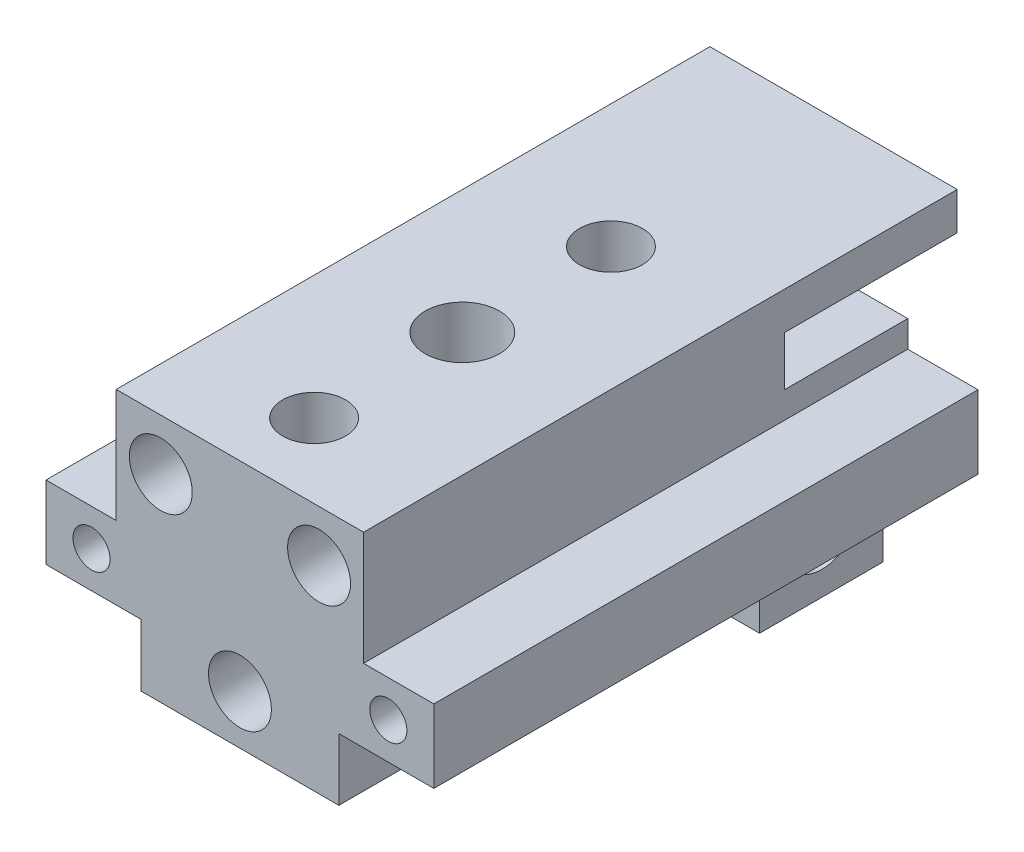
from build123d import *

# Parameters (mm, degrees)
SKETCH1_W                         = 24.892
SKETCH1_H                         = 38.1
EXTRUDE1_DEPTH                    = 9.9568
SKETCH2_W                         = 4.5085
SKETCH2_H                         = 7.2898
SKETCH2_W_2                       = 6.096
SKETCH2_H_2                       = 7.9248
CUT_EXTRUDE1_DEPTH                = 42.299525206
F_10_32_FINGER_MOUNT_HOLES_D      = 4.0386
F_10_32_FINGER_MOUNT_HOLES_DEPTH  = 13.613892
F_10_32_FINGER_MOUNT_HOLES_TIP    = 1.213317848
F_3_32_DOWEL_HOLES_SLIP_FIT_D     = 2.38125
F_3_32_DOWEL_HOLES_SLIP_FIT_DEPTH = 6.35
F_3_32_DOWEL_HOLES_SLIP_FIT_TIP   = 0.715399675
SKETCH8_W                         = 12.7
SKETCH8_H                         = 3.937
CUT_EXTRUDE2_DEPTH                = 27.0002
CUT_EXTRUDE3_DEPTH                = 3.175
SKETCH10_R                        = 2.3876
CUT_EXTRUDE4_DEPTH                = 29.553983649
SKETCH11_W                        = 7.9248
SKETCH11_H                        = 3.175
CUT_EXTRUDE5_DEPTH                = 30.623089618
SKETCH12_W                        = 6.604
SKETCH12_H                        = 7.9248
CUT_EXTRUDE6_DEPTH                = 22.225
F_10_32_TAPPED_HOLE2_D            = 4.0386
F_10_32_TAPPED_HOLE2_DEPTH        = 13.613892
F_10_32_TAPPED_HOLE2_TIP          = 1.213317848
F_3_16_DOWEL_HOLE_SLIP_FIT_D      = 4.7625
F_3_16_DOWEL_HOLE_SLIP_FIT_DEPTH  = 7.9248


with BuildPart() as part:
    # Sketch1 → Extrude1 (new, symmetric)
    with BuildSketch(Plane(origin=(0, 0, 0), x_dir=(1, 0, 0), z_dir=(0, 1, 0))):
        Rectangle(SKETCH1_W, SKETCH1_H)
    extrude(amount=EXTRUDE1_DEPTH, both=True)

    # Sketch2 → Cut-Extrude1 (cut, through all)
    with BuildSketch(Plane.XY.offset(19.05)):
        with Locations((-10.19175, 6.3119)):
            Rectangle(SKETCH2_W, SKETCH2_H)
        with Locations((10.19175, 6.3119)):
            Rectangle(SKETCH2_W, SKETCH2_H)
        with Locations((9.398, -5.9944)):
            Rectangle(SKETCH2_W_2, SKETCH2_H_2)
        with Locations((-9.398, -5.9944)):
            Rectangle(SKETCH2_W_2, SKETCH2_H_2)
    extrude(amount=-CUT_EXTRUDE1_DEPTH, mode=Mode.SUBTRACT)

    # 10-32 _Finger Mount Holes
    with Locations(Plane.XY.offset(19.05)):
        with Locations((-5.08, 6.6675), (5.08, 6.6675), (0, -2.8575)):
            Hole(F_10_32_FINGER_MOUNT_HOLES_D / 2, depth=F_10_32_FINGER_MOUNT_HOLES_DEPTH)
            with Locations((0, 0, -(F_10_32_FINGER_MOUNT_HOLES_DEPTH + F_10_32_FINGER_MOUNT_HOLES_TIP / 2))):  # 118° drill point
                Cone(0, F_10_32_FINGER_MOUNT_HOLES_D / 2, F_10_32_FINGER_MOUNT_HOLES_TIP, mode=Mode.SUBTRACT)

    # 3_32 Dowel Holes - Slip Fit
    with Locations(Plane.XY.offset(19.05)):
        with Locations((9.525, 0.3175), (-9.525, 0.3175)):
            Hole(F_3_32_DOWEL_HOLES_SLIP_FIT_D / 2, depth=F_3_32_DOWEL_HOLES_SLIP_FIT_DEPTH)
            with Locations((0, 0, -(F_3_32_DOWEL_HOLES_SLIP_FIT_DEPTH + F_3_32_DOWEL_HOLES_SLIP_FIT_TIP / 2))):  # 118° drill point
                Cone(0, F_3_32_DOWEL_HOLES_SLIP_FIT_D / 2, F_3_32_DOWEL_HOLES_SLIP_FIT_TIP, mode=Mode.SUBTRACT)

    # Sketch8 → Cut-Extrude2 (cut)
    with BuildSketch(Plane.XY.offset(19.05)):
        with Locations((0, -7.9883)):
            Rectangle(SKETCH8_W, SKETCH8_H)
    extrude(amount=-CUT_EXTRUDE2_DEPTH, mode=Mode.SUBTRACT)

    # Sketch9 → Cut-Extrude3 (cut)
    with BuildSketch(Plane(origin=(0, 0, -19.05), x_dir=(-1, 0, 0), z_dir=(0, 0, -1))):
        Polygon((-7.9375, 7.5438), (7.9375, 7.5438), (7.9375, 2.667), (12.446, 2.667), (12.446, -2.032), (6.35, -2.032), (6.35, -9.9568), (-6.35, -9.9568), (-6.35, -2.032), (-12.446, -2.032), (-12.446, 2.667), (-7.9375, 2.667), align=None)
    extrude(amount=-CUT_EXTRUDE3_DEPTH, mode=Mode.SUBTRACT)

    # Sketch10 → Cut-Extrude4 (cut, through all)
    with BuildSketch(Plane(origin=(6.35, 0, 0), x_dir=(0, 0, -1), z_dir=(1, 0, 0))):
        with Locations((11.938, -6.0198)):
            Circle(SKETCH10_R)
    extrude(amount=-CUT_EXTRUDE4_DEPTH, mode=Mode.SUBTRACT)

    # Sketch11 → Cut-Extrude5 (cut, through all)
    with BuildSketch(Plane(origin=(7.9375, 0, 0), x_dir=(0, 0, -1), z_dir=(1, 0, 0))):
        with Locations((11.9126, 5.9563)):
            Rectangle(SKETCH11_W, SKETCH11_H)
    extrude(amount=-CUT_EXTRUDE5_DEPTH, mode=Mode.SUBTRACT)

    # Sketch12 → Cut-Extrude6 (cut)
    with BuildSketch(Plane(origin=(0, 0, -15.875), x_dir=(-1, 0, 0), z_dir=(0, 0, -1))):
        with Locations((0, -5.9944)):
            Rectangle(SKETCH12_W, SKETCH12_H)
    extrude(amount=-CUT_EXTRUDE6_DEPTH, mode=Mode.SUBTRACT)

    # 10-32 Tapped Hole2
    with Locations(Plane(origin=(0, 9.9568, 0), x_dir=(-1, 0, 0), z_dir=(0, 1, 0))):
        with Locations((0, 14.2875), (0, -4.7625)):
            Hole(F_10_32_TAPPED_HOLE2_D / 2, depth=F_10_32_TAPPED_HOLE2_DEPTH)
            with Locations((0, 0, -(F_10_32_TAPPED_HOLE2_DEPTH + F_10_32_TAPPED_HOLE2_TIP / 2))):  # 118° drill point
                Cone(0, F_10_32_TAPPED_HOLE2_D / 2, F_10_32_TAPPED_HOLE2_TIP, mode=Mode.SUBTRACT)

    # 3_16 Dowel Hole - Slip Fit
    with Locations(Plane(origin=(0, 9.9568, 0), x_dir=(-1, 0, 0), z_dir=(0, 1, 0))):
        with Locations((0, 4.7752)):
            Hole(F_3_16_DOWEL_HOLE_SLIP_FIT_D / 2, depth=F_3_16_DOWEL_HOLE_SLIP_FIT_DEPTH)


solid = part.part
